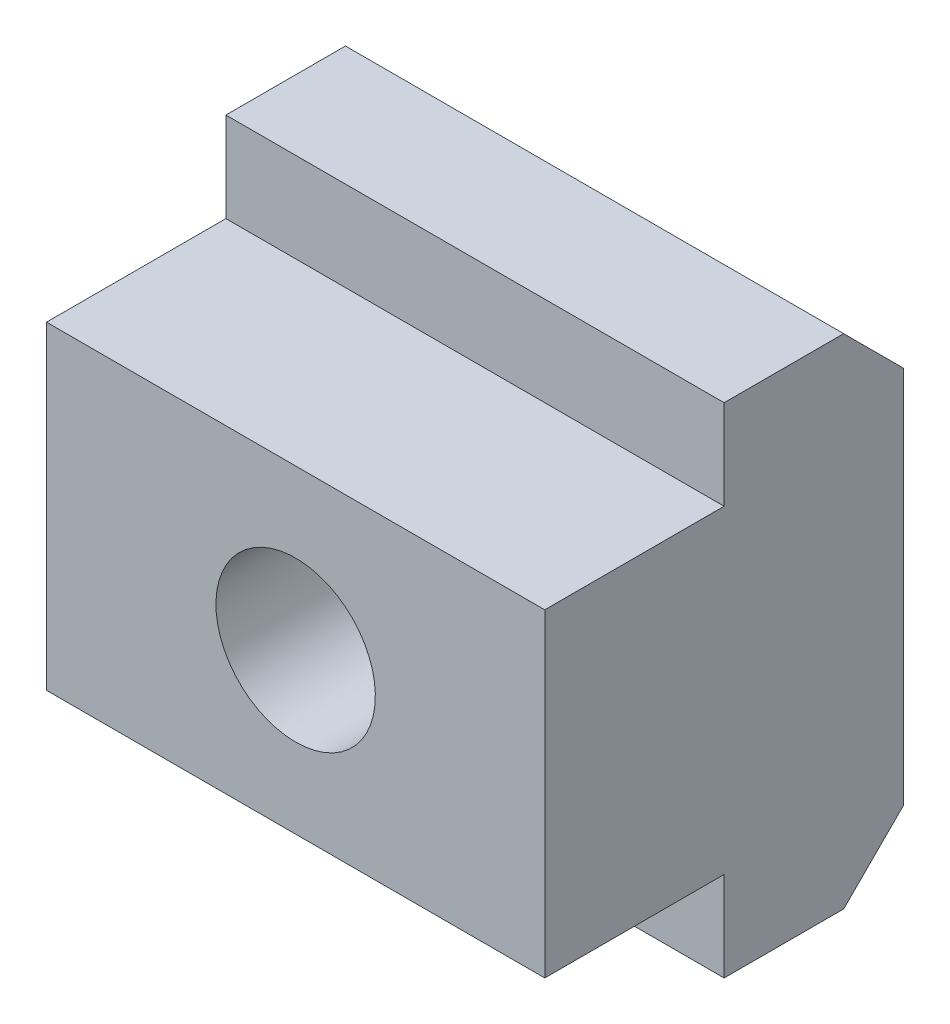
ISO-10303-21;
HEADER;
FILE_DESCRIPTION(('STEP AP214'),'2;1');
FILE_NAME('part.step','',(''),(''),'','','');
FILE_SCHEMA(('AUTOMOTIVE_DESIGN { 1 0 10303 214 1 1 1 1 }'));
ENDSEC;
DATA;
#1=APPLICATION_CONTEXT('core data for automotive mechanical design processes');
#2=APPLICATION_PROTOCOL_DEFINITION('international standard','automotive_design',2000,#1);
#3=PRODUCT_CONTEXT('',#1,'mechanical');
#4=PRODUCT('Part','Part','',(#3));
#5=PRODUCT_RELATED_PRODUCT_CATEGORY('part','',(#4));
#6=PRODUCT_DEFINITION_FORMATION('','',#4);
#7=PRODUCT_DEFINITION_CONTEXT('part definition',#1,'design');
#8=PRODUCT_DEFINITION('design','',#6,#7);
#9=PRODUCT_DEFINITION_SHAPE('','',#8);
#10=(LENGTH_UNIT() NAMED_UNIT(*) SI_UNIT(.MILLI.,.METRE.));
#11=(NAMED_UNIT(*) PLANE_ANGLE_UNIT() SI_UNIT($,.RADIAN.));
#12=(NAMED_UNIT(*) SI_UNIT($,.STERADIAN.) SOLID_ANGLE_UNIT());
#13=UNCERTAINTY_MEASURE_WITH_UNIT(LENGTH_MEASURE(1.E-05),#10,'distance_accuracy_value','');
#14=(GEOMETRIC_REPRESENTATION_CONTEXT(3) GLOBAL_UNCERTAINTY_ASSIGNED_CONTEXT((#13)) GLOBAL_UNIT_ASSIGNED_CONTEXT((#10,
#11,#12)) REPRESENTATION_CONTEXT('',''));
#15=CARTESIAN_POINT('',(0.,0.,0.));
#16=DIRECTION('',(0.,0.,1.));
#17=DIRECTION('',(1.,0.,0.));
#18=AXIS2_PLACEMENT_3D('',#15,#16,#17);
#19=CARTESIAN_POINT('',(12.5,8.,9.));
#20=DIRECTION('',(0.,-1.,0.));
#21=DIRECTION('',(0.,0.,-1.));
#22=AXIS2_PLACEMENT_3D('',#19,#20,#21);
#23=PLANE('',#22);
#24=DIRECTION('',(0.,0.,1.));
#25=VECTOR('',#24,1.);
#26=CARTESIAN_POINT('',(-12.5,8.,9.));
#27=LINE('',#26,#25);
#28=CARTESIAN_POINT('',(-12.5,8.,0.));
#29=VERTEX_POINT('',#28);
#30=CARTESIAN_POINT('',(-12.5,8.,9.));
#31=VERTEX_POINT('',#30);
#32=EDGE_CURVE('E98',#29,#31,#27,.T.);
#33=ORIENTED_EDGE('',*,*,#32,.T.);
#34=DIRECTION('',(-1.,0.,0.));
#35=VECTOR('',#34,1.);
#36=CARTESIAN_POINT('',(12.5,8.,9.));
#37=LINE('',#36,#35);
#38=CARTESIAN_POINT('',(12.5,8.,9.));
#39=VERTEX_POINT('',#38);
#40=EDGE_CURVE('E106',#39,#31,#37,.T.);
#41=ORIENTED_EDGE('',*,*,#40,.F.);
#42=DIRECTION('',(0.,0.,1.));
#43=VECTOR('',#42,1.);
#44=CARTESIAN_POINT('',(12.5,8.,9.));
#45=LINE('',#44,#43);
#46=CARTESIAN_POINT('',(12.5,8.,0.));
#47=VERTEX_POINT('',#46);
#48=EDGE_CURVE('E136',#47,#39,#45,.T.);
#49=ORIENTED_EDGE('',*,*,#48,.F.);
#50=DIRECTION('',(-1.,0.,0.));
#51=VECTOR('',#50,1.);
#52=CARTESIAN_POINT('',(12.5,8.,0.));
#53=LINE('',#52,#51);
#54=EDGE_CURVE('E117',#47,#29,#53,.T.);
#55=ORIENTED_EDGE('',*,*,#54,.T.);
#56=EDGE_LOOP('',(#33,#41,#49,#55));
#57=FACE_BOUND('',#56,.T.);
#58=ADVANCED_FACE('F14',(#57),#23,.F.);
#59=CARTESIAN_POINT('',(12.5,-8.,9.));
#60=DIRECTION('',(0.,0.,-1.));
#61=DIRECTION('',(0.,1.,0.));
#62=AXIS2_PLACEMENT_3D('',#59,#60,#61);
#63=PLANE('',#62);
#64=CARTESIAN_POINT('',(0.,0.,9.));
#65=DIRECTION('',(0.,0.,1.));
#66=DIRECTION('',(0.,-1.,0.));
#67=AXIS2_PLACEMENT_3D('',#64,#65,#66);
#68=CIRCLE('',#67,4.);
#69=CARTESIAN_POINT('',(0.,-4.00000000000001,9.));
#70=VERTEX_POINT('',#69);
#71=EDGE_CURVE('E121',#70,#70,#68,.T.);
#72=ORIENTED_EDGE('',*,*,#71,.F.);
#73=EDGE_LOOP('',(#72));
#74=FACE_BOUND('',#73,.T.);
#75=DIRECTION('',(0.,-1.,0.));
#76=VECTOR('',#75,1.);
#77=CARTESIAN_POINT('',(-12.5,-8.,9.));
#78=LINE('',#77,#76);
#79=CARTESIAN_POINT('',(-12.5,-8.,9.));
#80=VERTEX_POINT('',#79);
#81=EDGE_CURVE('E92',#31,#80,#78,.T.);
#82=ORIENTED_EDGE('',*,*,#81,.T.);
#83=DIRECTION('',(-1.,0.,0.));
#84=VECTOR('',#83,1.);
#85=CARTESIAN_POINT('',(12.5,-8.,9.));
#86=LINE('',#85,#84);
#87=CARTESIAN_POINT('',(12.5,-8.,9.));
#88=VERTEX_POINT('',#87);
#89=EDGE_CURVE('E113',#88,#80,#86,.T.);
#90=ORIENTED_EDGE('',*,*,#89,.F.);
#91=DIRECTION('',(0.,-1.,0.));
#92=VECTOR('',#91,1.);
#93=CARTESIAN_POINT('',(12.5,-8.,9.));
#94=LINE('',#93,#92);
#95=EDGE_CURVE('E108',#39,#88,#94,.T.);
#96=ORIENTED_EDGE('',*,*,#95,.F.);
#97=ORIENTED_EDGE('',*,*,#40,.T.);
#98=EDGE_LOOP('',(#82,#90,#96,#97));
#99=FACE_BOUND('',#98,.T.);
#100=ADVANCED_FACE('F107',(#74,#99),#63,.F.);
#101=CARTESIAN_POINT('',(12.5,-8.,9.));
#102=DIRECTION('',(0.,1.,0.));
#103=DIRECTION('',(-1.,0.,0.));
#104=AXIS2_PLACEMENT_3D('',#101,#102,#103);
#105=PLANE('',#104);
#106=DIRECTION('',(0.,0.,-1.));
#107=VECTOR('',#106,1.);
#108=CARTESIAN_POINT('',(-12.5,-8.,9.));
#109=LINE('',#108,#107);
#110=CARTESIAN_POINT('',(-12.5,-8.,0.));
#111=VERTEX_POINT('',#110);
#112=EDGE_CURVE('E100',#80,#111,#109,.T.);
#113=ORIENTED_EDGE('',*,*,#112,.T.);
#114=DIRECTION('',(-1.,0.,0.));
#115=VECTOR('',#114,1.);
#116=CARTESIAN_POINT('',(12.5,-8.,0.));
#117=LINE('',#116,#115);
#118=CARTESIAN_POINT('',(12.5,-8.,0.));
#119=VERTEX_POINT('',#118);
#120=EDGE_CURVE('E158',#119,#111,#117,.T.);
#121=ORIENTED_EDGE('',*,*,#120,.F.);
#122=DIRECTION('',(0.,0.,-1.));
#123=VECTOR('',#122,1.);
#124=CARTESIAN_POINT('',(12.5,-8.,9.));
#125=LINE('',#124,#123);
#126=EDGE_CURVE('E139',#88,#119,#125,.T.);
#127=ORIENTED_EDGE('',*,*,#126,.F.);
#128=ORIENTED_EDGE('',*,*,#89,.T.);
#129=EDGE_LOOP('',(#113,#121,#127,#128));
#130=FACE_BOUND('',#129,.T.);
#131=ADVANCED_FACE('F199',(#130),#105,.F.);
#132=CARTESIAN_POINT('',(12.5,-8.,0.));
#133=DIRECTION('',(0.,0.,-1.));
#134=DIRECTION('',(0.,1.,0.));
#135=AXIS2_PLACEMENT_3D('',#132,#133,#134);
#136=PLANE('',#135);
#137=DIRECTION('',(0.,-1.,0.));
#138=VECTOR('',#137,1.);
#139=CARTESIAN_POINT('',(-12.5,-8.,0.));
#140=LINE('',#139,#138);
#141=CARTESIAN_POINT('',(-12.5,-12.5,0.));
#142=VERTEX_POINT('',#141);
#143=EDGE_CURVE('E126',#111,#142,#140,.T.);
#144=ORIENTED_EDGE('',*,*,#143,.T.);
#145=DIRECTION('',(-1.,0.,0.));
#146=VECTOR('',#145,1.);
#147=CARTESIAN_POINT('',(12.5,-12.5,0.));
#148=LINE('',#147,#146);
#149=CARTESIAN_POINT('',(12.5,-12.5,0.));
#150=VERTEX_POINT('',#149);
#151=EDGE_CURVE('E155',#150,#142,#148,.T.);
#152=ORIENTED_EDGE('',*,*,#151,.F.);
#153=DIRECTION('',(0.,-1.,0.));
#154=VECTOR('',#153,1.);
#155=CARTESIAN_POINT('',(12.5,-8.,0.));
#156=LINE('',#155,#154);
#157=EDGE_CURVE('E141',#119,#150,#156,.T.);
#158=ORIENTED_EDGE('',*,*,#157,.F.);
#159=ORIENTED_EDGE('',*,*,#120,.T.);
#160=EDGE_LOOP('',(#144,#152,#158,#159));
#161=FACE_BOUND('',#160,.T.);
#162=ADVANCED_FACE('F195',(#161),#136,.F.);
#163=CARTESIAN_POINT('',(12.5,-12.5,0.));
#164=DIRECTION('',(0.,1.,0.));
#165=DIRECTION('',(0.,0.,1.));
#166=AXIS2_PLACEMENT_3D('',#163,#164,#165);
#167=PLANE('',#166);
#168=DIRECTION('',(0.,0.,-1.));
#169=VECTOR('',#168,1.);
#170=CARTESIAN_POINT('',(-12.5,-12.5,0.));
#171=LINE('',#170,#169);
#172=CARTESIAN_POINT('',(-12.5,-12.5,-6.));
#173=VERTEX_POINT('',#172);
#174=EDGE_CURVE('E128',#142,#173,#171,.T.);
#175=ORIENTED_EDGE('',*,*,#174,.T.);
#176=DIRECTION('',(1.,0.,0.));
#177=VECTOR('',#176,1.);
#178=CARTESIAN_POINT('',(12.5,-12.5,-6.));
#179=LINE('',#178,#177);
#180=CARTESIAN_POINT('',(12.5,-12.5,-6.));
#181=VERTEX_POINT('',#180);
#182=EDGE_CURVE('E9',#173,#181,#179,.T.);
#183=ORIENTED_EDGE('',*,*,#182,.T.);
#184=DIRECTION('',(0.,0.,-1.));
#185=VECTOR('',#184,1.);
#186=CARTESIAN_POINT('',(12.5,-12.5,0.));
#187=LINE('',#186,#185);
#188=EDGE_CURVE('E143',#150,#181,#187,.T.);
#189=ORIENTED_EDGE('',*,*,#188,.F.);
#190=ORIENTED_EDGE('',*,*,#151,.T.);
#191=EDGE_LOOP('',(#175,#183,#189,#190));
#192=FACE_BOUND('',#191,.T.);
#193=ADVANCED_FACE('F191',(#192),#167,.F.);
#194=CARTESIAN_POINT('',(12.5,-12.5,-9.));
#195=DIRECTION('',(0.,0.,1.));
#196=DIRECTION('',(0.,-1.,0.));
#197=AXIS2_PLACEMENT_3D('',#194,#195,#196);
#198=PLANE('',#197);
#199=CARTESIAN_POINT('',(0.,0.,-9.));
#200=DIRECTION('',(0.,0.,1.));
#201=DIRECTION('',(0.,-1.,0.));
#202=AXIS2_PLACEMENT_3D('',#199,#200,#201);
#203=CIRCLE('',#202,4.);
#204=CARTESIAN_POINT('',(0.,-4.,-9.));
#205=VERTEX_POINT('',#204);
#206=EDGE_CURVE('E118',#205,#205,#203,.T.);
#207=ORIENTED_EDGE('',*,*,#206,.T.);
#208=EDGE_LOOP('',(#207));
#209=FACE_BOUND('',#208,.T.);
#210=DIRECTION('',(0.,1.,0.));
#211=VECTOR('',#210,1.);
#212=CARTESIAN_POINT('',(-12.5,-12.5,-9.));
#213=LINE('',#212,#211);
#214=CARTESIAN_POINT('',(-12.5,-9.5,-9.));
#215=VERTEX_POINT('',#214);
#216=CARTESIAN_POINT('',(-12.5,9.5,-9.));
#217=VERTEX_POINT('',#216);
#218=EDGE_CURVE('E130',#215,#217,#213,.T.);
#219=ORIENTED_EDGE('',*,*,#218,.T.);
#220=DIRECTION('',(1.,0.,0.));
#221=VECTOR('',#220,1.);
#222=CARTESIAN_POINT('',(12.5,9.5,-9.));
#223=LINE('',#222,#221);
#224=CARTESIAN_POINT('',(12.5,9.5,-9.));
#225=VERTEX_POINT('',#224);
#226=EDGE_CURVE('E34',#217,#225,#223,.T.);
#227=ORIENTED_EDGE('',*,*,#226,.T.);
#228=DIRECTION('',(0.,1.,0.));
#229=VECTOR('',#228,1.);
#230=CARTESIAN_POINT('',(12.5,-12.5,-9.));
#231=LINE('',#230,#229);
#232=CARTESIAN_POINT('',(12.5,-9.5,-9.));
#233=VERTEX_POINT('',#232);
#234=EDGE_CURVE('E145',#233,#225,#231,.T.);
#235=ORIENTED_EDGE('',*,*,#234,.F.);
#236=DIRECTION('',(-1.,0.,0.));
#237=VECTOR('',#236,1.);
#238=CARTESIAN_POINT('',(12.5,-9.5,-9.));
#239=LINE('',#238,#237);
#240=EDGE_CURVE('E168',#233,#215,#239,.T.);
#241=ORIENTED_EDGE('',*,*,#240,.T.);
#242=EDGE_LOOP('',(#219,#227,#235,#241));
#243=FACE_BOUND('',#242,.T.);
#244=ADVANCED_FACE('F185',(#209,#243),#198,.F.);
#245=CARTESIAN_POINT('',(12.5,12.5,0.));
#246=DIRECTION('',(0.,-1.,0.));
#247=DIRECTION('',(0.,0.,-1.));
#248=AXIS2_PLACEMENT_3D('',#245,#246,#247);
#249=PLANE('',#248);
#250=DIRECTION('',(0.,0.,1.));
#251=VECTOR('',#250,1.);
#252=CARTESIAN_POINT('',(12.5,12.5,0.));
#253=LINE('',#252,#251);
#254=CARTESIAN_POINT('',(12.5,12.5,-6.));
#255=VERTEX_POINT('',#254);
#256=CARTESIAN_POINT('',(12.5,12.5,0.));
#257=VERTEX_POINT('',#256);
#258=EDGE_CURVE('E147',#255,#257,#253,.T.);
#259=ORIENTED_EDGE('',*,*,#258,.F.);
#260=DIRECTION('',(-1.,0.,0.));
#261=VECTOR('',#260,1.);
#262=CARTESIAN_POINT('',(12.5,12.5,-6.));
#263=LINE('',#262,#261);
#264=CARTESIAN_POINT('',(-12.5,12.5,-6.));
#265=VERTEX_POINT('',#264);
#266=EDGE_CURVE('E112',#255,#265,#263,.T.);
#267=ORIENTED_EDGE('',*,*,#266,.T.);
#268=DIRECTION('',(0.,0.,1.));
#269=VECTOR('',#268,1.);
#270=CARTESIAN_POINT('',(-12.5,12.5,0.));
#271=LINE('',#270,#269);
#272=CARTESIAN_POINT('',(-12.5,12.5,0.));
#273=VERTEX_POINT('',#272);
#274=EDGE_CURVE('E132',#265,#273,#271,.T.);
#275=ORIENTED_EDGE('',*,*,#274,.T.);
#276=DIRECTION('',(-1.,0.,0.));
#277=VECTOR('',#276,1.);
#278=CARTESIAN_POINT('',(12.5,12.5,0.));
#279=LINE('',#278,#277);
#280=EDGE_CURVE('E152',#257,#273,#279,.T.);
#281=ORIENTED_EDGE('',*,*,#280,.F.);
#282=EDGE_LOOP('',(#259,#267,#275,#281));
#283=FACE_BOUND('',#282,.T.);
#284=ADVANCED_FACE('F181',(#283),#249,.F.);
#285=CARTESIAN_POINT('',(12.5,8.,0.));
#286=DIRECTION('',(0.,0.,-1.));
#287=DIRECTION('',(0.,1.,0.));
#288=AXIS2_PLACEMENT_3D('',#285,#286,#287);
#289=PLANE('',#288);
#290=DIRECTION('',(0.,-1.,0.));
#291=VECTOR('',#290,1.);
#292=CARTESIAN_POINT('',(-12.5,8.,0.));
#293=LINE('',#292,#291);
#294=EDGE_CURVE('E134',#273,#29,#293,.T.);
#295=ORIENTED_EDGE('',*,*,#294,.T.);
#296=ORIENTED_EDGE('',*,*,#54,.F.);
#297=DIRECTION('',(0.,-1.,0.));
#298=VECTOR('',#297,1.);
#299=CARTESIAN_POINT('',(12.5,8.,0.));
#300=LINE('',#299,#298);
#301=EDGE_CURVE('E149',#257,#47,#300,.T.);
#302=ORIENTED_EDGE('',*,*,#301,.F.);
#303=ORIENTED_EDGE('',*,*,#280,.T.);
#304=EDGE_LOOP('',(#295,#296,#302,#303));
#305=FACE_BOUND('',#304,.T.);
#306=ADVANCED_FACE('F201',(#305),#289,.F.);
#307=CARTESIAN_POINT('',(12.5,8.,9.));
#308=DIRECTION('',(1.,0.,0.));
#309=DIRECTION('',(0.,1.,0.));
#310=AXIS2_PLACEMENT_3D('',#307,#308,#309);
#311=PLANE('',#310);
#312=ORIENTED_EDGE('',*,*,#234,.T.);
#313=DIRECTION('',(0.,-0.707106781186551,-0.707106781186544));
#314=VECTOR('',#313,1.);
#315=CARTESIAN_POINT('',(12.5,17.75,-0.75));
#316=LINE('',#315,#314);
#317=EDGE_CURVE('E21',#225,#255,#316,.F.);
#318=ORIENTED_EDGE('',*,*,#317,.T.);
#319=ORIENTED_EDGE('',*,*,#258,.T.);
#320=ORIENTED_EDGE('',*,*,#301,.T.);
#321=ORIENTED_EDGE('',*,*,#48,.T.);
#322=ORIENTED_EDGE('',*,*,#95,.T.);
#323=ORIENTED_EDGE('',*,*,#126,.T.);
#324=ORIENTED_EDGE('',*,*,#157,.T.);
#325=ORIENTED_EDGE('',*,*,#188,.T.);
#326=DIRECTION('',(0.,-0.707106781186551,0.707106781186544));
#327=VECTOR('',#326,1.);
#328=CARTESIAN_POINT('',(12.5,-9.74999999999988,-8.75));
#329=LINE('',#328,#327);
#330=EDGE_CURVE('E172',#181,#233,#329,.F.);
#331=ORIENTED_EDGE('',*,*,#330,.T.);
#332=EDGE_LOOP('',(#312,#318,#319,#320,#321,#322,#323,#324,#325,#331));
#333=FACE_BOUND('',#332,.T.);
#334=ADVANCED_FACE('F176',(#333),#311,.T.);
#335=CARTESIAN_POINT('',(-12.5,8.,9.));
#336=DIRECTION('',(1.,0.,0.));
#337=DIRECTION('',(0.,1.,0.));
#338=AXIS2_PLACEMENT_3D('',#335,#336,#337);
#339=PLANE('',#338);
#340=ORIENTED_EDGE('',*,*,#274,.F.);
#341=DIRECTION('',(0.,0.707106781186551,0.707106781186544));
#342=VECTOR('',#341,1.);
#343=CARTESIAN_POINT('',(-12.5,12.5,-6.));
#344=LINE('',#343,#342);
#345=EDGE_CURVE('E166',#265,#217,#344,.F.);
#346=ORIENTED_EDGE('',*,*,#345,.T.);
#347=ORIENTED_EDGE('',*,*,#218,.F.);
#348=DIRECTION('',(0.,0.707106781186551,-0.707106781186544));
#349=VECTOR('',#348,1.);
#350=CARTESIAN_POINT('',(-12.5,-9.5,-9.));
#351=LINE('',#350,#349);
#352=EDGE_CURVE('E164',#215,#173,#351,.F.);
#353=ORIENTED_EDGE('',*,*,#352,.T.);
#354=ORIENTED_EDGE('',*,*,#174,.F.);
#355=ORIENTED_EDGE('',*,*,#143,.F.);
#356=ORIENTED_EDGE('',*,*,#112,.F.);
#357=ORIENTED_EDGE('',*,*,#81,.F.);
#358=ORIENTED_EDGE('',*,*,#32,.F.);
#359=ORIENTED_EDGE('',*,*,#294,.F.);
#360=EDGE_LOOP('',(#340,#346,#347,#353,#354,#355,#356,#357,#358,#359));
#361=FACE_BOUND('',#360,.T.);
#362=ADVANCED_FACE('F95',(#361),#339,.F.);
#363=CARTESIAN_POINT('',(12.5,12.5,-6.));
#364=DIRECTION('',(0.,-0.707106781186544,0.707106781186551));
#365=DIRECTION('',(0.,-0.707106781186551,-0.707106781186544));
#366=AXIS2_PLACEMENT_3D('',#363,#364,#365);
#367=PLANE('',#366);
#368=ORIENTED_EDGE('',*,*,#317,.F.);
#369=ORIENTED_EDGE('',*,*,#226,.F.);
#370=ORIENTED_EDGE('',*,*,#345,.F.);
#371=ORIENTED_EDGE('',*,*,#266,.F.);
#372=EDGE_LOOP('',(#368,#369,#370,#371));
#373=FACE_BOUND('',#372,.T.);
#374=ADVANCED_FACE('F183',(#373),#367,.F.);
#375=CARTESIAN_POINT('',(12.5,-9.5,-9.));
#376=DIRECTION('',(0.,0.707106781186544,0.707106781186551));
#377=DIRECTION('',(0.,-0.707106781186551,0.707106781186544));
#378=AXIS2_PLACEMENT_3D('',#375,#376,#377);
#379=PLANE('',#378);
#380=ORIENTED_EDGE('',*,*,#330,.F.);
#381=ORIENTED_EDGE('',*,*,#182,.F.);
#382=ORIENTED_EDGE('',*,*,#352,.F.);
#383=ORIENTED_EDGE('',*,*,#240,.F.);
#384=EDGE_LOOP('',(#380,#381,#382,#383));
#385=FACE_BOUND('',#384,.T.);
#386=ADVANCED_FACE('F189',(#385),#379,.F.);
#387=CARTESIAN_POINT('',(0.,0.,-9.));
#388=DIRECTION('',(0.,0.,1.));
#389=DIRECTION('',(0.,-1.,0.));
#390=AXIS2_PLACEMENT_3D('',#387,#388,#389);
#391=CYLINDRICAL_SURFACE('',#390,4.);
#392=ORIENTED_EDGE('',*,*,#206,.F.);
#393=EDGE_LOOP('',(#392));
#394=FACE_BOUND('',#393,.T.);
#395=ORIENTED_EDGE('',*,*,#71,.T.);
#396=EDGE_LOOP('',(#395));
#397=FACE_BOUND('',#396,.T.);
#398=ADVANCED_FACE('F236',(#394,#397),#391,.F.);
#399=CLOSED_SHELL('',(#58,#100,#131,#162,#193,#244,#284,#306,#334,#362,#374,#386,#398));
#400=MANIFOLD_SOLID_BREP('B1',#399);
#401=ADVANCED_BREP_SHAPE_REPRESENTATION('',(#18,#400),#14);
#402=SHAPE_DEFINITION_REPRESENTATION(#9,#401);
ENDSEC;
END-ISO-10303-21;
